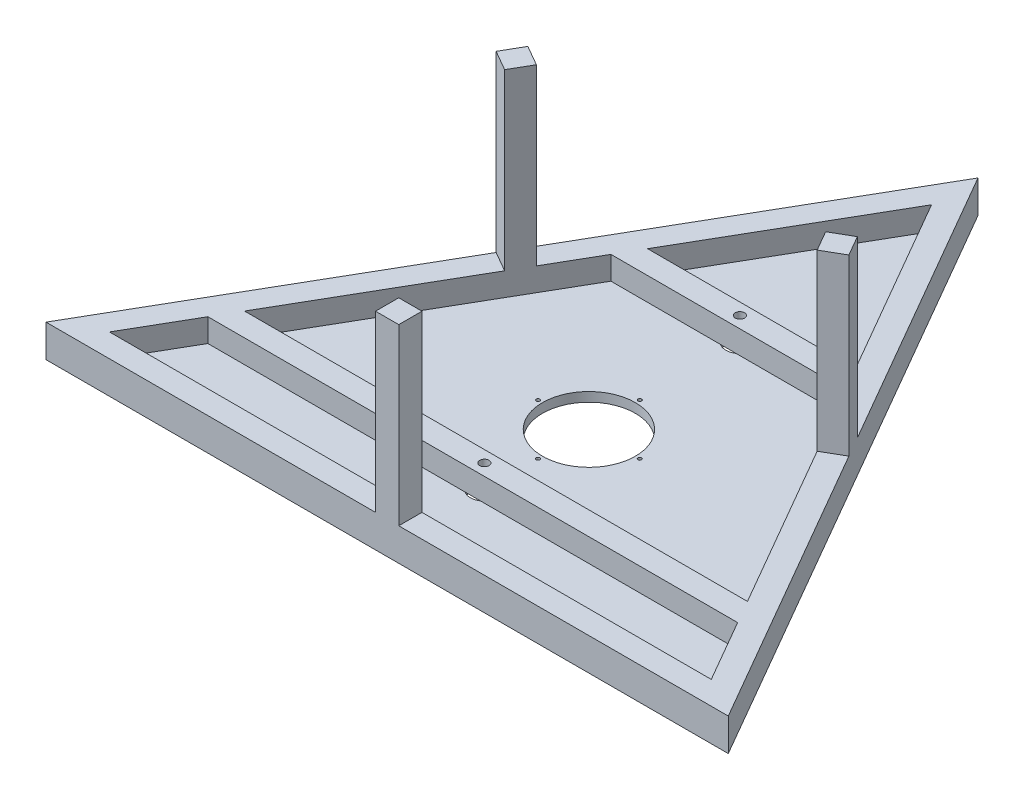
ISO-10303-21;
HEADER;
FILE_DESCRIPTION(('STEP AP214'),'2;1');
FILE_NAME('part.step','',(''),(''),'','','');
FILE_SCHEMA(('AUTOMOTIVE_DESIGN { 1 0 10303 214 1 1 1 1 }'));
ENDSEC;
DATA;
#1=APPLICATION_CONTEXT('core data for automotive mechanical design processes');
#2=APPLICATION_PROTOCOL_DEFINITION('international standard','automotive_design',2000,#1);
#3=PRODUCT_CONTEXT('',#1,'mechanical');
#4=PRODUCT('Part','Part','',(#3));
#5=PRODUCT_RELATED_PRODUCT_CATEGORY('part','',(#4));
#6=PRODUCT_DEFINITION_FORMATION('','',#4);
#7=PRODUCT_DEFINITION_CONTEXT('part definition',#1,'design');
#8=PRODUCT_DEFINITION('design','',#6,#7);
#9=PRODUCT_DEFINITION_SHAPE('','',#8);
#10=(LENGTH_UNIT() NAMED_UNIT(*) SI_UNIT(.MILLI.,.METRE.));
#11=(NAMED_UNIT(*) PLANE_ANGLE_UNIT() SI_UNIT($,.RADIAN.));
#12=(NAMED_UNIT(*) SI_UNIT($,.STERADIAN.) SOLID_ANGLE_UNIT());
#13=UNCERTAINTY_MEASURE_WITH_UNIT(LENGTH_MEASURE(1.E-05),#10,'distance_accuracy_value','');
#14=(GEOMETRIC_REPRESENTATION_CONTEXT(3) GLOBAL_UNCERTAINTY_ASSIGNED_CONTEXT((#13)) GLOBAL_UNIT_ASSIGNED_CONTEXT((#10,
#11,#12)) REPRESENTATION_CONTEXT('',''));
#15=CARTESIAN_POINT('',(0.,0.,0.));
#16=DIRECTION('',(0.,0.,1.));
#17=DIRECTION('',(1.,0.,0.));
#18=AXIS2_PLACEMENT_3D('',#15,#16,#17);
#19=CARTESIAN_POINT('',(0.,0.,0.));
#20=DIRECTION('',(0.,1.,0.));
#21=DIRECTION('',(0.,0.,1.));
#22=AXIS2_PLACEMENT_3D('',#19,#20,#21);
#23=PLANE('',#22);
#24=CARTESIAN_POINT('',(0.,0.,130.));
#25=DIRECTION('',(0.,1.,0.));
#26=DIRECTION('',(0.,0.,1.));
#27=AXIS2_PLACEMENT_3D('',#24,#25,#26);
#28=CIRCLE('',#27,4.);
#29=CARTESIAN_POINT('',(0.,0.,134.));
#30=VERTEX_POINT('',#29);
#31=EDGE_CURVE('E425',#30,#30,#28,.T.);
#32=ORIENTED_EDGE('',*,*,#31,.T.);
#33=EDGE_LOOP('',(#32));
#34=FACE_BOUND('',#33,.T.);
#35=DIRECTION('',(1.,0.,0.));
#36=VECTOR('',#35,1.);
#37=CARTESIAN_POINT('',(0.,0.,120.));
#38=LINE('',#37,#36);
#39=CARTESIAN_POINT('',(-6.63324958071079,0.,120.));
#40=VERTEX_POINT('',#39);
#41=CARTESIAN_POINT('',(6.63324958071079,0.,120.));
#42=VERTEX_POINT('',#41);
#43=EDGE_CURVE('E480',#40,#42,#38,.T.);
#44=ORIENTED_EDGE('',*,*,#43,.T.);
#45=CARTESIAN_POINT('',(0.,0.,130.));
#46=DIRECTION('',(0.,-1.,0.));
#47=DIRECTION('',(0.,0.,-1.));
#48=AXIS2_PLACEMENT_3D('',#45,#46,#47);
#49=CIRCLE('',#48,12.);
#50=CARTESIAN_POINT('',(6.63324958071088,0.,140.));
#51=VERTEX_POINT('',#50);
#52=EDGE_CURVE('E130',#42,#51,#49,.T.);
#53=ORIENTED_EDGE('',*,*,#52,.T.);
#54=DIRECTION('',(1.,0.,0.));
#55=VECTOR('',#54,1.);
#56=CARTESIAN_POINT('',(0.,0.,140.));
#57=LINE('',#56,#55);
#58=CARTESIAN_POINT('',(-6.63324958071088,0.,140.));
#59=VERTEX_POINT('',#58);
#60=EDGE_CURVE('E517',#59,#51,#57,.T.);
#61=ORIENTED_EDGE('',*,*,#60,.F.);
#62=EDGE_CURVE('E12',#59,#40,#49,.T.);
#63=ORIENTED_EDGE('',*,*,#62,.T.);
#64=EDGE_LOOP('',(#44,#53,#61,#63));
#65=FACE_BOUND('',#64,.T.);
#66=ADVANCED_FACE('F119',(#34,#65),#23,.F.);
#67=CARTESIAN_POINT('',(0.,0.,-90.));
#68=DIRECTION('',(0.,1.,0.));
#69=DIRECTION('',(0.,0.,1.));
#70=AXIS2_PLACEMENT_3D('',#67,#68,#69);
#71=CIRCLE('',#70,4.);
#72=CARTESIAN_POINT('',(0.,0.,-86.));
#73=VERTEX_POINT('',#72);
#74=EDGE_CURVE('E429',#73,#73,#71,.T.);
#75=ORIENTED_EDGE('',*,*,#74,.T.);
#76=EDGE_LOOP('',(#75));
#77=FACE_BOUND('',#76,.T.);
#78=DIRECTION('',(1.,0.,0.));
#79=VECTOR('',#78,1.);
#80=CARTESIAN_POINT('',(0.,0.,-100.));
#81=LINE('',#80,#79);
#82=CARTESIAN_POINT('',(-6.63324958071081,0.,-100.));
#83=VERTEX_POINT('',#82);
#84=CARTESIAN_POINT('',(6.63324958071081,0.,-100.));
#85=VERTEX_POINT('',#84);
#86=EDGE_CURVE('E450',#83,#85,#81,.T.);
#87=ORIENTED_EDGE('',*,*,#86,.T.);
#88=CARTESIAN_POINT('',(0.,0.,-90.));
#89=DIRECTION('',(0.,-1.,0.));
#90=DIRECTION('',(0.,0.,-1.));
#91=AXIS2_PLACEMENT_3D('',#88,#89,#90);
#92=CIRCLE('',#91,12.);
#93=CARTESIAN_POINT('',(6.63324958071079,0.,-80.));
#94=VERTEX_POINT('',#93);
#95=EDGE_CURVE('E642',#85,#94,#92,.T.);
#96=ORIENTED_EDGE('',*,*,#95,.T.);
#97=DIRECTION('',(1.,0.,0.));
#98=VECTOR('',#97,1.);
#99=CARTESIAN_POINT('',(0.,0.,-80.));
#100=LINE('',#99,#98);
#101=CARTESIAN_POINT('',(-6.63324958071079,0.,-80.));
#102=VERTEX_POINT('',#101);
#103=EDGE_CURVE('E486',#102,#94,#100,.T.);
#104=ORIENTED_EDGE('',*,*,#103,.F.);
#105=EDGE_CURVE('E128',#102,#83,#92,.T.);
#106=ORIENTED_EDGE('',*,*,#105,.T.);
#107=EDGE_LOOP('',(#87,#96,#104,#106));
#108=FACE_BOUND('',#107,.T.);
#109=ADVANCED_FACE('F681',(#77,#108),#23,.F.);
#110=CARTESIAN_POINT('',(0.,20.,0.));
#111=DIRECTION('',(0.,1.,0.));
#112=DIRECTION('',(0.,0.,1.));
#113=AXIS2_PLACEMENT_3D('',#110,#111,#112);
#114=PLANE('',#113);
#115=DIRECTION('',(-0.5,0.,-0.866025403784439));
#116=VECTOR('',#115,1.);
#117=CARTESIAN_POINT('',(110.418238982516,20.,-63.75));
#118=LINE('',#117,#116);
#119=CARTESIAN_POINT('',(89.489291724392,20.,-100.));
#120=VERTEX_POINT('',#119);
#121=CARTESIAN_POINT('',(0.,20.,-255.));
#122=VERTEX_POINT('',#121);
#123=EDGE_CURVE('E440',#120,#122,#118,.T.);
#124=ORIENTED_EDGE('',*,*,#123,.F.);
#125=DIRECTION('',(1.,0.,0.));
#126=VECTOR('',#125,1.);
#127=CARTESIAN_POINT('',(0.,20.,-100.));
#128=LINE('',#127,#126);
#129=CARTESIAN_POINT('',(-89.489291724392,20.,-100.));
#130=VERTEX_POINT('',#129);
#131=EDGE_CURVE('E438',#130,#120,#128,.T.);
#132=ORIENTED_EDGE('',*,*,#131,.F.);
#133=DIRECTION('',(-0.5,0.,0.866025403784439));
#134=VECTOR('',#133,1.);
#135=CARTESIAN_POINT('',(-110.418238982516,20.,-63.75));
#136=LINE('',#135,#134);
#137=EDGE_CURVE('E444',#122,#130,#136,.T.);
#138=ORIENTED_EDGE('',*,*,#137,.F.);
#139=EDGE_LOOP('',(#124,#132,#138));
#140=FACE_BOUND('',#139,.T.);
#141=CARTESIAN_POINT('',(0.,20.,-90.));
#142=DIRECTION('',(0.,1.,0.));
#143=DIRECTION('',(0.,0.,1.));
#144=AXIS2_PLACEMENT_3D('',#141,#142,#143);
#145=CIRCLE('',#144,4.);
#146=CARTESIAN_POINT('',(0.,20.,-86.));
#147=VERTEX_POINT('',#146);
#148=EDGE_CURVE('E432',#147,#147,#145,.T.);
#149=ORIENTED_EDGE('',*,*,#148,.F.);
#150=EDGE_LOOP('',(#149));
#151=FACE_BOUND('',#150,.T.);
#152=DIRECTION('',(-0.5,0.,-0.866025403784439));
#153=VECTOR('',#152,1.);
#154=CARTESIAN_POINT('',(110.418238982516,20.,-63.75));
#155=LINE('',#154,#153);
#156=CARTESIAN_POINT('',(124.533666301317,20.,-39.301362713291));
#157=VERTEX_POINT('',#156);
#158=CARTESIAN_POINT('',(101.036297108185,20.,-80.));
#159=VERTEX_POINT('',#158);
#160=EDGE_CURVE('E464',#157,#159,#155,.T.);
#161=ORIENTED_EDGE('',*,*,#160,.F.);
#162=DIRECTION('',(-0.866025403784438,0.,0.500000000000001));
#163=VECTOR('',#162,1.);
#164=CARTESIAN_POINT('',(141.854174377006,20.,-49.301362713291));
#165=LINE('',#164,#163);
#166=CARTESIAN_POINT('',(141.854174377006,20.,-49.301362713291));
#167=VERTEX_POINT('',#166);
#168=EDGE_CURVE('E360',#167,#157,#165,.T.);
#169=ORIENTED_EDGE('',*,*,#168,.F.);
#170=DIRECTION('',(-0.5,0.,-0.866025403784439));
#171=VECTOR('',#170,1.);
#172=CARTESIAN_POINT('',(293.708348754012,20.,213.717782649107));
#173=LINE('',#172,#171);
#174=CARTESIAN_POINT('',(0.,20.,-295.));
#175=VERTEX_POINT('',#174);
#176=EDGE_CURVE('E537',#167,#175,#173,.T.);
#177=ORIENTED_EDGE('',*,*,#176,.T.);
#178=DIRECTION('',(-0.5,0.,0.866025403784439));
#179=VECTOR('',#178,1.);
#180=CARTESIAN_POINT('',(0.,20.,-295.));
#181=LINE('',#180,#179);
#182=CARTESIAN_POINT('',(-141.854174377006,20.,-49.3013627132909));
#183=VERTEX_POINT('',#182);
#184=EDGE_CURVE('E540',#175,#183,#181,.T.);
#185=ORIENTED_EDGE('',*,*,#184,.T.);
#186=DIRECTION('',(-0.866025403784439,0.,-0.5));
#187=VECTOR('',#186,1.);
#188=CARTESIAN_POINT('',(-14.115427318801,20.,24.4486372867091));
#189=LINE('',#188,#187);
#190=CARTESIAN_POINT('',(-124.533666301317,20.,-39.3013627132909));
#191=VERTEX_POINT('',#190);
#192=EDGE_CURVE('E391',#191,#183,#189,.T.);
#193=ORIENTED_EDGE('',*,*,#192,.F.);
#194=DIRECTION('',(-0.5,0.,0.866025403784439));
#195=VECTOR('',#194,1.);
#196=CARTESIAN_POINT('',(-110.418238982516,20.,-63.75));
#197=LINE('',#196,#195);
#198=CARTESIAN_POINT('',(-101.036297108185,20.,-80.));
#199=VERTEX_POINT('',#198);
#200=EDGE_CURVE('E473',#199,#191,#197,.T.);
#201=ORIENTED_EDGE('',*,*,#200,.F.);
#202=DIRECTION('',(1.,0.,0.));
#203=VECTOR('',#202,1.);
#204=CARTESIAN_POINT('',(0.,20.,-80.));
#205=LINE('',#204,#203);
#206=EDGE_CURVE('E469',#199,#159,#205,.T.);
#207=ORIENTED_EDGE('',*,*,#206,.T.);
#208=EDGE_LOOP('',(#161,#169,#177,#185,#193,#201,#207));
#209=FACE_BOUND('',#208,.T.);
#210=ADVANCED_FACE('F550',(#140,#151,#209),#114,.T.);
#211=DIRECTION('',(-0.866025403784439,0.,0.499999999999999));
#212=VECTOR('',#211,1.);
#213=CARTESIAN_POINT('',(151.854174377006,20.,-31.9808546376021));
#214=LINE('',#213,#212);
#215=CARTESIAN_POINT('',(151.854174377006,20.,-31.9808546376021));
#216=VERTEX_POINT('',#215);
#217=CARTESIAN_POINT('',(134.533666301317,20.,-21.9808546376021));
#218=VERTEX_POINT('',#217);
#219=EDGE_CURVE('E362',#216,#218,#214,.T.);
#220=ORIENTED_EDGE('',*,*,#219,.T.);
#221=CARTESIAN_POINT('',(216.50635094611,20.,120.));
#222=VERTEX_POINT('',#221);
#223=EDGE_CURVE('E466',#222,#218,#155,.T.);
#224=ORIENTED_EDGE('',*,*,#223,.F.);
#225=DIRECTION('',(1.,0.,0.));
#226=VECTOR('',#225,1.);
#227=CARTESIAN_POINT('',(0.,20.,120.));
#228=LINE('',#227,#226);
#229=CARTESIAN_POINT('',(-216.50635094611,20.,120.));
#230=VERTEX_POINT('',#229);
#231=EDGE_CURVE('E462',#230,#222,#228,.T.);
#232=ORIENTED_EDGE('',*,*,#231,.F.);
#233=CARTESIAN_POINT('',(-134.533666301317,20.,-21.9808546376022));
#234=VERTEX_POINT('',#233);
#235=EDGE_CURVE('E472',#234,#230,#197,.T.);
#236=ORIENTED_EDGE('',*,*,#235,.F.);
#237=DIRECTION('',(-0.866025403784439,0.,-0.5));
#238=VECTOR('',#237,1.);
#239=CARTESIAN_POINT('',(-24.115427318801,20.,41.7691453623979));
#240=LINE('',#239,#238);
#241=CARTESIAN_POINT('',(-151.854174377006,20.,-31.9808546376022));
#242=VERTEX_POINT('',#241);
#243=EDGE_CURVE('E403',#234,#242,#240,.T.);
#244=ORIENTED_EDGE('',*,*,#243,.T.);
#245=CARTESIAN_POINT('',(-293.708348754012,20.,213.717782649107));
#246=VERTEX_POINT('',#245);
#247=EDGE_CURVE('E539',#242,#246,#181,.T.);
#248=ORIENTED_EDGE('',*,*,#247,.T.);
#249=DIRECTION('',(1.,0.,0.));
#250=VECTOR('',#249,1.);
#251=CARTESIAN_POINT('',(-293.708348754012,20.,213.717782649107));
#252=LINE('',#251,#250);
#253=CARTESIAN_POINT('',(-10.,20.,213.717782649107));
#254=VERTEX_POINT('',#253);
#255=EDGE_CURVE('E534',#246,#254,#252,.T.);
#256=ORIENTED_EDGE('',*,*,#255,.T.);
#257=DIRECTION('',(0.,0.,1.));
#258=VECTOR('',#257,1.);
#259=CARTESIAN_POINT('',(-10.,20.,0.));
#260=LINE('',#259,#258);
#261=CARTESIAN_POINT('',(-10.,20.,193.717782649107));
#262=VERTEX_POINT('',#261);
#263=EDGE_CURVE('E385',#262,#254,#260,.T.);
#264=ORIENTED_EDGE('',*,*,#263,.F.);
#265=DIRECTION('',(1.,0.,0.));
#266=VECTOR('',#265,1.);
#267=CARTESIAN_POINT('',(0.,20.,193.717782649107));
#268=LINE('',#267,#266);
#269=CARTESIAN_POINT('',(-259.067332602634,20.,193.717782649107));
#270=VERTEX_POINT('',#269);
#271=EDGE_CURVE('E507',#270,#262,#268,.T.);
#272=ORIENTED_EDGE('',*,*,#271,.F.);
#273=DIRECTION('',(-0.499999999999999,0.,0.866025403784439));
#274=VECTOR('',#273,1.);
#275=CARTESIAN_POINT('',(-110.418238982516,20.,-63.75));
#276=LINE('',#275,#274);
#277=CARTESIAN_POINT('',(-228.053356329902,20.,140.));
#278=VERTEX_POINT('',#277);
#279=EDGE_CURVE('E503',#278,#270,#276,.T.);
#280=ORIENTED_EDGE('',*,*,#279,.F.);
#281=DIRECTION('',(1.,0.,0.));
#282=VECTOR('',#281,1.);
#283=CARTESIAN_POINT('',(0.,20.,140.));
#284=LINE('',#283,#282);
#285=CARTESIAN_POINT('',(228.053356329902,20.,140.));
#286=VERTEX_POINT('',#285);
#287=EDGE_CURVE('E500',#278,#286,#284,.T.);
#288=ORIENTED_EDGE('',*,*,#287,.T.);
#289=DIRECTION('',(-0.5,0.,-0.866025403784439));
#290=VECTOR('',#289,1.);
#291=CARTESIAN_POINT('',(110.418238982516,20.,-63.75));
#292=LINE('',#291,#290);
#293=CARTESIAN_POINT('',(259.067332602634,20.,193.717782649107));
#294=VERTEX_POINT('',#293);
#295=EDGE_CURVE('E510',#294,#286,#292,.T.);
#296=ORIENTED_EDGE('',*,*,#295,.F.);
#297=CARTESIAN_POINT('',(10.,20.,193.717782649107));
#298=VERTEX_POINT('',#297);
#299=EDGE_CURVE('E506',#298,#294,#268,.T.);
#300=ORIENTED_EDGE('',*,*,#299,.F.);
#301=DIRECTION('',(0.,0.,1.));
#302=VECTOR('',#301,1.);
#303=CARTESIAN_POINT('',(9.99999999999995,20.,0.));
#304=LINE('',#303,#302);
#305=CARTESIAN_POINT('',(10.,20.,213.717782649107));
#306=VERTEX_POINT('',#305);
#307=EDGE_CURVE('E387',#298,#306,#304,.T.);
#308=ORIENTED_EDGE('',*,*,#307,.T.);
#309=CARTESIAN_POINT('',(293.708348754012,20.,213.717782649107));
#310=VERTEX_POINT('',#309);
#311=EDGE_CURVE('E533',#306,#310,#252,.T.);
#312=ORIENTED_EDGE('',*,*,#311,.T.);
#313=EDGE_CURVE('E328',#310,#216,#173,.T.);
#314=ORIENTED_EDGE('',*,*,#313,.T.);
#315=EDGE_LOOP('',(#220,#224,#232,#236,#244,#248,#256,#264,#272,#280,#288,#296,#300,#308,#312,#314));
#316=FACE_BOUND('',#315,.T.);
#317=CARTESIAN_POINT('',(0.,20.,130.));
#318=DIRECTION('',(0.,1.,0.));
#319=DIRECTION('',(0.,0.,1.));
#320=AXIS2_PLACEMENT_3D('',#317,#318,#319);
#321=CIRCLE('',#320,4.);
#322=CARTESIAN_POINT('',(0.,20.,134.));
#323=VERTEX_POINT('',#322);
#324=EDGE_CURVE('E426',#323,#323,#321,.T.);
#325=ORIENTED_EDGE('',*,*,#324,.F.);
#326=EDGE_LOOP('',(#325));
#327=FACE_BOUND('',#326,.T.);
#328=ADVANCED_FACE('F563',(#316,#327),#114,.T.);
#329=CARTESIAN_POINT('',(-293.708348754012,20.,213.717782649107));
#330=DIRECTION('',(0.,0.,-1.));
#331=DIRECTION('',(-1.,0.,0.));
#332=AXIS2_PLACEMENT_3D('',#329,#330,#331);
#333=PLANE('',#332);
#334=DIRECTION('',(0.,-1.,0.));
#335=VECTOR('',#334,1.);
#336=CARTESIAN_POINT('',(-293.708348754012,20.,213.717782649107));
#337=LINE('',#336,#335);
#338=CARTESIAN_POINT('',(-293.708348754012,-8.,213.717782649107));
#339=VERTEX_POINT('',#338);
#340=EDGE_CURVE('E336',#246,#339,#337,.T.);
#341=ORIENTED_EDGE('',*,*,#340,.T.);
#342=DIRECTION('',(-1.,0.,0.));
#343=VECTOR('',#342,1.);
#344=CARTESIAN_POINT('',(-293.708348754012,-8.,213.717782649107));
#345=LINE('',#344,#343);
#346=CARTESIAN_POINT('',(293.708348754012,-8.,213.717782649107));
#347=VERTEX_POINT('',#346);
#348=EDGE_CURVE('E333',#347,#339,#345,.T.);
#349=ORIENTED_EDGE('',*,*,#348,.F.);
#350=DIRECTION('',(0.,-1.,0.));
#351=VECTOR('',#350,1.);
#352=CARTESIAN_POINT('',(293.708348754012,20.,213.717782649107));
#353=LINE('',#352,#351);
#354=EDGE_CURVE('E123',#310,#347,#353,.T.);
#355=ORIENTED_EDGE('',*,*,#354,.F.);
#356=ORIENTED_EDGE('',*,*,#311,.F.);
#357=DIRECTION('',(0.,-1.,0.));
#358=VECTOR('',#357,1.);
#359=CARTESIAN_POINT('',(10.,170.,213.717782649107));
#360=LINE('',#359,#358);
#361=CARTESIAN_POINT('',(10.,170.,213.717782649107));
#362=VERTEX_POINT('',#361);
#363=EDGE_CURVE('E382',#362,#306,#360,.T.);
#364=ORIENTED_EDGE('',*,*,#363,.F.);
#365=DIRECTION('',(1.,0.,0.));
#366=VECTOR('',#365,1.);
#367=CARTESIAN_POINT('',(0.,170.,213.717782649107));
#368=LINE('',#367,#366);
#369=CARTESIAN_POINT('',(-10.,170.,213.717782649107));
#370=VERTEX_POINT('',#369);
#371=EDGE_CURVE('E384',#370,#362,#368,.T.);
#372=ORIENTED_EDGE('',*,*,#371,.F.);
#373=DIRECTION('',(0.,-1.,0.));
#374=VECTOR('',#373,1.);
#375=CARTESIAN_POINT('',(-10.,170.,213.717782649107));
#376=LINE('',#375,#374);
#377=EDGE_CURVE('E379',#370,#254,#376,.T.);
#378=ORIENTED_EDGE('',*,*,#377,.T.);
#379=ORIENTED_EDGE('',*,*,#255,.F.);
#380=EDGE_LOOP('',(#341,#349,#355,#356,#364,#372,#378,#379));
#381=FACE_BOUND('',#380,.T.);
#382=ADVANCED_FACE('F121',(#381),#333,.F.);
#383=CARTESIAN_POINT('',(293.708348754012,20.,213.717782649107));
#384=DIRECTION('',(-0.866025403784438,0.,0.5));
#385=DIRECTION('',(0.5,0.,0.866025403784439));
#386=AXIS2_PLACEMENT_3D('',#383,#384,#385);
#387=PLANE('',#386);
#388=ORIENTED_EDGE('',*,*,#354,.T.);
#389=DIRECTION('',(0.5,0.,0.866025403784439));
#390=VECTOR('',#389,1.);
#391=CARTESIAN_POINT('',(293.708348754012,-8.,213.717782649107));
#392=LINE('',#391,#390);
#393=CARTESIAN_POINT('',(0.,-8.,-295.));
#394=VERTEX_POINT('',#393);
#395=EDGE_CURVE('E326',#394,#347,#392,.T.);
#396=ORIENTED_EDGE('',*,*,#395,.F.);
#397=DIRECTION('',(0.,-1.,0.));
#398=VECTOR('',#397,1.);
#399=CARTESIAN_POINT('',(0.,20.,-295.));
#400=LINE('',#399,#398);
#401=EDGE_CURVE('E331',#175,#394,#400,.T.);
#402=ORIENTED_EDGE('',*,*,#401,.F.);
#403=ORIENTED_EDGE('',*,*,#176,.F.);
#404=DIRECTION('',(0.,-1.,0.));
#405=VECTOR('',#404,1.);
#406=CARTESIAN_POINT('',(141.854174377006,170.,-49.301362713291));
#407=LINE('',#406,#405);
#408=CARTESIAN_POINT('',(141.854174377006,170.,-49.301362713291));
#409=VERTEX_POINT('',#408);
#410=EDGE_CURVE('E352',#409,#167,#407,.T.);
#411=ORIENTED_EDGE('',*,*,#410,.F.);
#412=DIRECTION('',(0.5,0.,0.866025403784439));
#413=VECTOR('',#412,1.);
#414=CARTESIAN_POINT('',(141.854174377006,170.,-49.301362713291));
#415=LINE('',#414,#413);
#416=CARTESIAN_POINT('',(151.854174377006,170.,-31.9808546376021));
#417=VERTEX_POINT('',#416);
#418=EDGE_CURVE('E363',#409,#417,#415,.T.);
#419=ORIENTED_EDGE('',*,*,#418,.T.);
#420=DIRECTION('',(0.,-1.,0.));
#421=VECTOR('',#420,1.);
#422=CARTESIAN_POINT('',(151.854174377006,170.,-31.9808546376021));
#423=LINE('',#422,#421);
#424=EDGE_CURVE('E353',#417,#216,#423,.T.);
#425=ORIENTED_EDGE('',*,*,#424,.T.);
#426=ORIENTED_EDGE('',*,*,#313,.F.);
#427=EDGE_LOOP('',(#388,#396,#402,#403,#411,#419,#425,#426));
#428=FACE_BOUND('',#427,.T.);
#429=ADVANCED_FACE('F323',(#428),#387,.F.);
#430=CARTESIAN_POINT('',(0.,20.,-295.));
#431=DIRECTION('',(0.866025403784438,0.,0.5));
#432=DIRECTION('',(0.5,0.,-0.866025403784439));
#433=AXIS2_PLACEMENT_3D('',#430,#431,#432);
#434=PLANE('',#433);
#435=ORIENTED_EDGE('',*,*,#401,.T.);
#436=DIRECTION('',(0.5,0.,-0.866025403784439));
#437=VECTOR('',#436,1.);
#438=CARTESIAN_POINT('',(0.,-8.,-295.));
#439=LINE('',#438,#437);
#440=EDGE_CURVE('E340',#339,#394,#439,.T.);
#441=ORIENTED_EDGE('',*,*,#440,.F.);
#442=ORIENTED_EDGE('',*,*,#340,.F.);
#443=ORIENTED_EDGE('',*,*,#247,.F.);
#444=DIRECTION('',(0.,-1.,0.));
#445=VECTOR('',#444,1.);
#446=CARTESIAN_POINT('',(-151.854174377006,170.,-31.9808546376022));
#447=LINE('',#446,#445);
#448=CARTESIAN_POINT('',(-151.854174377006,170.,-31.9808546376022));
#449=VERTEX_POINT('',#448);
#450=EDGE_CURVE('E416',#449,#242,#447,.T.);
#451=ORIENTED_EDGE('',*,*,#450,.F.);
#452=DIRECTION('',(-0.5,0.,0.866025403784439));
#453=VECTOR('',#452,1.);
#454=CARTESIAN_POINT('',(-127.738747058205,170.,-73.7500000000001));
#455=LINE('',#454,#453);
#456=CARTESIAN_POINT('',(-141.854174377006,170.,-49.3013627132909));
#457=VERTEX_POINT('',#456);
#458=EDGE_CURVE('E405',#457,#449,#455,.T.);
#459=ORIENTED_EDGE('',*,*,#458,.F.);
#460=DIRECTION('',(0.,-1.,0.));
#461=VECTOR('',#460,1.);
#462=CARTESIAN_POINT('',(-141.854174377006,170.,-49.3013627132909));
#463=LINE('',#462,#461);
#464=EDGE_CURVE('E419',#457,#183,#463,.T.);
#465=ORIENTED_EDGE('',*,*,#464,.T.);
#466=ORIENTED_EDGE('',*,*,#184,.F.);
#467=EDGE_LOOP('',(#435,#441,#442,#443,#451,#459,#465,#466));
#468=FACE_BOUND('',#467,.T.);
#469=ADVANCED_FACE('F544',(#468),#434,.F.);
#470=CARTESIAN_POINT('',(0.,20.,140.));
#471=DIRECTION('',(0.,0.,-1.));
#472=DIRECTION('',(-1.,0.,0.));
#473=AXIS2_PLACEMENT_3D('',#470,#471,#472);
#474=PLANE('',#473);
#475=CARTESIAN_POINT('',(-228.053356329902,0.,140.));
#476=VERTEX_POINT('',#475);
#477=EDGE_CURVE('E513',#476,#59,#57,.T.);
#478=ORIENTED_EDGE('',*,*,#477,.T.);
#479=ORIENTED_EDGE('',*,*,#60,.T.);
#480=CARTESIAN_POINT('',(228.053356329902,0.,140.));
#481=VERTEX_POINT('',#480);
#482=EDGE_CURVE('E499',#51,#481,#57,.T.);
#483=ORIENTED_EDGE('',*,*,#482,.T.);
#484=DIRECTION('',(0.,-1.,0.));
#485=VECTOR('',#484,1.);
#486=CARTESIAN_POINT('',(228.053356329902,20.,140.));
#487=LINE('',#486,#485);
#488=EDGE_CURVE('E512',#286,#481,#487,.T.);
#489=ORIENTED_EDGE('',*,*,#488,.F.);
#490=ORIENTED_EDGE('',*,*,#287,.F.);
#491=DIRECTION('',(0.,-1.,0.));
#492=VECTOR('',#491,1.);
#493=CARTESIAN_POINT('',(-228.053356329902,20.,140.));
#494=LINE('',#493,#492);
#495=EDGE_CURVE('E530',#278,#476,#494,.T.);
#496=ORIENTED_EDGE('',*,*,#495,.T.);
#497=EDGE_LOOP('',(#478,#479,#483,#489,#490,#496));
#498=FACE_BOUND('',#497,.T.);
#499=ADVANCED_FACE('F633',(#498),#474,.F.);
#500=CARTESIAN_POINT('',(-110.418238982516,20.,-63.75));
#501=DIRECTION('',(0.866025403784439,0.,0.499999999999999));
#502=DIRECTION('',(0.499999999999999,0.,-0.866025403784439));
#503=AXIS2_PLACEMENT_3D('',#500,#501,#502);
#504=PLANE('',#503);
#505=DIRECTION('',(-0.499999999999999,0.,0.866025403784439));
#506=VECTOR('',#505,1.);
#507=CARTESIAN_POINT('',(-110.418238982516,0.,-63.75));
#508=LINE('',#507,#506);
#509=CARTESIAN_POINT('',(-259.067332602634,0.,193.717782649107));
#510=VERTEX_POINT('',#509);
#511=EDGE_CURVE('E516',#476,#510,#508,.T.);
#512=ORIENTED_EDGE('',*,*,#511,.F.);
#513=ORIENTED_EDGE('',*,*,#495,.F.);
#514=ORIENTED_EDGE('',*,*,#279,.T.);
#515=DIRECTION('',(0.,-1.,0.));
#516=VECTOR('',#515,1.);
#517=CARTESIAN_POINT('',(-259.067332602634,20.,193.717782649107));
#518=LINE('',#517,#516);
#519=EDGE_CURVE('E527',#270,#510,#518,.T.);
#520=ORIENTED_EDGE('',*,*,#519,.T.);
#521=EDGE_LOOP('',(#512,#513,#514,#520));
#522=FACE_BOUND('',#521,.T.);
#523=ADVANCED_FACE('F771',(#522),#504,.T.);
#524=CARTESIAN_POINT('',(0.,20.,193.717782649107));
#525=DIRECTION('',(0.,0.,-1.));
#526=DIRECTION('',(-1.,0.,0.));
#527=AXIS2_PLACEMENT_3D('',#524,#525,#526);
#528=PLANE('',#527);
#529=DIRECTION('',(1.,0.,0.));
#530=VECTOR('',#529,1.);
#531=CARTESIAN_POINT('',(0.,0.,193.717782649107));
#532=LINE('',#531,#530);
#533=CARTESIAN_POINT('',(259.067332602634,0.,193.717782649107));
#534=VERTEX_POINT('',#533);
#535=EDGE_CURVE('E519',#510,#534,#532,.T.);
#536=ORIENTED_EDGE('',*,*,#535,.F.);
#537=ORIENTED_EDGE('',*,*,#519,.F.);
#538=ORIENTED_EDGE('',*,*,#271,.T.);
#539=DIRECTION('',(0.,-1.,0.));
#540=VECTOR('',#539,1.);
#541=CARTESIAN_POINT('',(-10.,170.,193.717782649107));
#542=LINE('',#541,#540);
#543=CARTESIAN_POINT('',(-10.,170.,193.717782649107));
#544=VERTEX_POINT('',#543);
#545=EDGE_CURVE('E377',#544,#262,#542,.T.);
#546=ORIENTED_EDGE('',*,*,#545,.F.);
#547=DIRECTION('',(-1.,0.,0.));
#548=VECTOR('',#547,1.);
#549=CARTESIAN_POINT('',(0.,170.,193.717782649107));
#550=LINE('',#549,#548);
#551=CARTESIAN_POINT('',(10.,170.,193.717782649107));
#552=VERTEX_POINT('',#551);
#553=EDGE_CURVE('E395',#552,#544,#550,.T.);
#554=ORIENTED_EDGE('',*,*,#553,.F.);
#555=DIRECTION('',(0.,-1.,0.));
#556=VECTOR('',#555,1.);
#557=CARTESIAN_POINT('',(10.,170.,193.717782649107));
#558=LINE('',#557,#556);
#559=EDGE_CURVE('E366',#552,#298,#558,.T.);
#560=ORIENTED_EDGE('',*,*,#559,.T.);
#561=ORIENTED_EDGE('',*,*,#299,.T.);
#562=DIRECTION('',(0.,-1.,0.));
#563=VECTOR('',#562,1.);
#564=CARTESIAN_POINT('',(259.067332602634,20.,193.717782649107));
#565=LINE('',#564,#563);
#566=EDGE_CURVE('E524',#294,#534,#565,.T.);
#567=ORIENTED_EDGE('',*,*,#566,.T.);
#568=EDGE_LOOP('',(#536,#537,#538,#546,#554,#560,#561,#567));
#569=FACE_BOUND('',#568,.T.);
#570=ADVANCED_FACE('F780',(#569),#528,.T.);
#571=CARTESIAN_POINT('',(110.418238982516,20.,-63.75));
#572=DIRECTION('',(-0.866025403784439,0.,0.5));
#573=DIRECTION('',(0.5,0.,0.866025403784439));
#574=AXIS2_PLACEMENT_3D('',#571,#572,#573);
#575=PLANE('',#574);
#576=DIRECTION('',(-0.5,0.,-0.866025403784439));
#577=VECTOR('',#576,1.);
#578=CARTESIAN_POINT('',(110.418238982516,0.,-63.75));
#579=LINE('',#578,#577);
#580=EDGE_CURVE('E504',#534,#481,#579,.T.);
#581=ORIENTED_EDGE('',*,*,#580,.F.);
#582=ORIENTED_EDGE('',*,*,#566,.F.);
#583=ORIENTED_EDGE('',*,*,#295,.T.);
#584=ORIENTED_EDGE('',*,*,#488,.T.);
#585=EDGE_LOOP('',(#581,#582,#583,#584));
#586=FACE_BOUND('',#585,.T.);
#587=ADVANCED_FACE('F791',(#586),#575,.T.);
#588=CARTESIAN_POINT('',(0.,20.,120.));
#589=DIRECTION('',(0.,0.,-1.));
#590=DIRECTION('',(-1.,0.,0.));
#591=AXIS2_PLACEMENT_3D('',#588,#589,#590);
#592=PLANE('',#591);
#593=CARTESIAN_POINT('',(-216.50635094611,0.,120.));
#594=VERTEX_POINT('',#593);
#595=EDGE_CURVE('E477',#594,#40,#38,.T.);
#596=ORIENTED_EDGE('',*,*,#595,.F.);
#597=DIRECTION('',(0.,-1.,0.));
#598=VECTOR('',#597,1.);
#599=CARTESIAN_POINT('',(-216.50635094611,20.,120.));
#600=LINE('',#599,#598);
#601=EDGE_CURVE('E476',#230,#594,#600,.T.);
#602=ORIENTED_EDGE('',*,*,#601,.F.);
#603=ORIENTED_EDGE('',*,*,#231,.T.);
#604=DIRECTION('',(0.,-1.,0.));
#605=VECTOR('',#604,1.);
#606=CARTESIAN_POINT('',(216.50635094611,20.,120.));
#607=LINE('',#606,#605);
#608=CARTESIAN_POINT('',(216.50635094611,0.,120.));
#609=VERTEX_POINT('',#608);
#610=EDGE_CURVE('E496',#222,#609,#607,.T.);
#611=ORIENTED_EDGE('',*,*,#610,.T.);
#612=EDGE_CURVE('E461',#42,#609,#38,.T.);
#613=ORIENTED_EDGE('',*,*,#612,.F.);
#614=ORIENTED_EDGE('',*,*,#43,.F.);
#615=EDGE_LOOP('',(#596,#602,#603,#611,#613,#614));
#616=FACE_BOUND('',#615,.T.);
#617=ADVANCED_FACE('F612',(#616),#592,.T.);
#618=CARTESIAN_POINT('',(110.418238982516,20.,-63.75));
#619=DIRECTION('',(-0.866025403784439,0.,0.5));
#620=DIRECTION('',(0.5,0.,0.866025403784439));
#621=AXIS2_PLACEMENT_3D('',#618,#619,#620);
#622=PLANE('',#621);
#623=DIRECTION('',(-0.5,0.,-0.866025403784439));
#624=VECTOR('',#623,1.);
#625=CARTESIAN_POINT('',(110.418238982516,0.,-63.75));
#626=LINE('',#625,#624);
#627=CARTESIAN_POINT('',(101.036297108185,0.,-80.));
#628=VERTEX_POINT('',#627);
#629=EDGE_CURVE('E479',#609,#628,#626,.T.);
#630=ORIENTED_EDGE('',*,*,#629,.F.);
#631=ORIENTED_EDGE('',*,*,#610,.F.);
#632=ORIENTED_EDGE('',*,*,#223,.T.);
#633=DIRECTION('',(0.,-1.,0.));
#634=VECTOR('',#633,1.);
#635=CARTESIAN_POINT('',(134.533666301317,170.,-21.9808546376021));
#636=LINE('',#635,#634);
#637=CARTESIAN_POINT('',(134.533666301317,170.,-21.9808546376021));
#638=VERTEX_POINT('',#637);
#639=EDGE_CURVE('E356',#638,#218,#636,.T.);
#640=ORIENTED_EDGE('',*,*,#639,.F.);
#641=DIRECTION('',(0.5,0.,0.866025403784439));
#642=VECTOR('',#641,1.);
#643=CARTESIAN_POINT('',(124.533666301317,170.,-39.3013627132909));
#644=LINE('',#643,#642);
#645=CARTESIAN_POINT('',(124.533666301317,170.,-39.3013627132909));
#646=VERTEX_POINT('',#645);
#647=EDGE_CURVE('E368',#646,#638,#644,.T.);
#648=ORIENTED_EDGE('',*,*,#647,.F.);
#649=DIRECTION('',(0.,-1.,0.));
#650=VECTOR('',#649,1.);
#651=CARTESIAN_POINT('',(124.533666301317,170.,-39.3013627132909));
#652=LINE('',#651,#650);
#653=EDGE_CURVE('E146',#646,#157,#652,.T.);
#654=ORIENTED_EDGE('',*,*,#653,.T.);
#655=ORIENTED_EDGE('',*,*,#160,.T.);
#656=DIRECTION('',(0.,-1.,0.));
#657=VECTOR('',#656,1.);
#658=CARTESIAN_POINT('',(101.036297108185,20.,-80.));
#659=LINE('',#658,#657);
#660=EDGE_CURVE('E493',#159,#628,#659,.T.);
#661=ORIENTED_EDGE('',*,*,#660,.T.);
#662=EDGE_LOOP('',(#630,#631,#632,#640,#648,#654,#655,#661));
#663=FACE_BOUND('',#662,.T.);
#664=ADVANCED_FACE('F606',(#663),#622,.T.);
#665=CARTESIAN_POINT('',(0.,20.,-80.));
#666=DIRECTION('',(0.,0.,-1.));
#667=DIRECTION('',(-1.,0.,0.));
#668=AXIS2_PLACEMENT_3D('',#665,#666,#667);
#669=PLANE('',#668);
#670=CARTESIAN_POINT('',(-101.036297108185,0.,-80.));
#671=VERTEX_POINT('',#670);
#672=EDGE_CURVE('E483',#671,#102,#100,.T.);
#673=ORIENTED_EDGE('',*,*,#672,.T.);
#674=ORIENTED_EDGE('',*,*,#103,.T.);
#675=EDGE_CURVE('E482',#94,#628,#100,.T.);
#676=ORIENTED_EDGE('',*,*,#675,.T.);
#677=ORIENTED_EDGE('',*,*,#660,.F.);
#678=ORIENTED_EDGE('',*,*,#206,.F.);
#679=DIRECTION('',(0.,-1.,0.));
#680=VECTOR('',#679,1.);
#681=CARTESIAN_POINT('',(-101.036297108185,20.,-80.));
#682=LINE('',#681,#680);
#683=EDGE_CURVE('E490',#199,#671,#682,.T.);
#684=ORIENTED_EDGE('',*,*,#683,.T.);
#685=EDGE_LOOP('',(#673,#674,#676,#677,#678,#684));
#686=FACE_BOUND('',#685,.T.);
#687=ADVANCED_FACE('F601',(#686),#669,.F.);
#688=CARTESIAN_POINT('',(-110.418238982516,20.,-63.75));
#689=DIRECTION('',(0.866025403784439,0.,0.5));
#690=DIRECTION('',(0.5,0.,-0.866025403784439));
#691=AXIS2_PLACEMENT_3D('',#688,#689,#690);
#692=PLANE('',#691);
#693=DIRECTION('',(-0.5,0.,0.866025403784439));
#694=VECTOR('',#693,1.);
#695=CARTESIAN_POINT('',(-110.418238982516,0.,-63.75));
#696=LINE('',#695,#694);
#697=EDGE_CURVE('E465',#671,#594,#696,.T.);
#698=ORIENTED_EDGE('',*,*,#697,.F.);
#699=ORIENTED_EDGE('',*,*,#683,.F.);
#700=ORIENTED_EDGE('',*,*,#200,.T.);
#701=DIRECTION('',(0.,-1.,0.));
#702=VECTOR('',#701,1.);
#703=CARTESIAN_POINT('',(-124.533666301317,170.,-39.3013627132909));
#704=LINE('',#703,#702);
#705=CARTESIAN_POINT('',(-124.533666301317,170.,-39.3013627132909));
#706=VERTEX_POINT('',#705);
#707=EDGE_CURVE('E422',#706,#191,#704,.T.);
#708=ORIENTED_EDGE('',*,*,#707,.F.);
#709=DIRECTION('',(0.5,0.,-0.866025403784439));
#710=VECTOR('',#709,1.);
#711=CARTESIAN_POINT('',(-110.418238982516,170.,-63.75));
#712=LINE('',#711,#710);
#713=CARTESIAN_POINT('',(-134.533666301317,170.,-21.9808546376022));
#714=VERTEX_POINT('',#713);
#715=EDGE_CURVE('E399',#714,#706,#712,.T.);
#716=ORIENTED_EDGE('',*,*,#715,.F.);
#717=DIRECTION('',(0.,-1.,0.));
#718=VECTOR('',#717,1.);
#719=CARTESIAN_POINT('',(-134.533666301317,170.,-21.9808546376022));
#720=LINE('',#719,#718);
#721=EDGE_CURVE('E410',#714,#234,#720,.T.);
#722=ORIENTED_EDGE('',*,*,#721,.T.);
#723=ORIENTED_EDGE('',*,*,#235,.T.);
#724=ORIENTED_EDGE('',*,*,#601,.T.);
#725=EDGE_LOOP('',(#698,#699,#700,#708,#716,#722,#723,#724));
#726=FACE_BOUND('',#725,.T.);
#727=ADVANCED_FACE('F599',(#726),#692,.T.);
#728=CARTESIAN_POINT('',(0.,20.,-100.));
#729=DIRECTION('',(0.,0.,-1.));
#730=DIRECTION('',(-1.,0.,0.));
#731=AXIS2_PLACEMENT_3D('',#728,#729,#730);
#732=PLANE('',#731);
#733=CARTESIAN_POINT('',(-89.489291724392,0.,-100.));
#734=VERTEX_POINT('',#733);
#735=EDGE_CURVE('E447',#734,#83,#81,.T.);
#736=ORIENTED_EDGE('',*,*,#735,.F.);
#737=DIRECTION('',(0.,-1.,0.));
#738=VECTOR('',#737,1.);
#739=CARTESIAN_POINT('',(-89.489291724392,20.,-100.));
#740=LINE('',#739,#738);
#741=EDGE_CURVE('E446',#130,#734,#740,.T.);
#742=ORIENTED_EDGE('',*,*,#741,.F.);
#743=ORIENTED_EDGE('',*,*,#131,.T.);
#744=DIRECTION('',(0.,-1.,0.));
#745=VECTOR('',#744,1.);
#746=CARTESIAN_POINT('',(89.489291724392,20.,-100.));
#747=LINE('',#746,#745);
#748=CARTESIAN_POINT('',(89.489291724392,0.,-100.));
#749=VERTEX_POINT('',#748);
#750=EDGE_CURVE('E458',#120,#749,#747,.T.);
#751=ORIENTED_EDGE('',*,*,#750,.T.);
#752=EDGE_CURVE('E435',#85,#749,#81,.T.);
#753=ORIENTED_EDGE('',*,*,#752,.F.);
#754=ORIENTED_EDGE('',*,*,#86,.F.);
#755=EDGE_LOOP('',(#736,#742,#743,#751,#753,#754));
#756=FACE_BOUND('',#755,.T.);
#757=ADVANCED_FACE('F685',(#756),#732,.T.);
#758=CARTESIAN_POINT('',(110.418238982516,20.,-63.75));
#759=DIRECTION('',(-0.866025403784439,0.,0.5));
#760=DIRECTION('',(0.5,0.,0.866025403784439));
#761=AXIS2_PLACEMENT_3D('',#758,#759,#760);
#762=PLANE('',#761);
#763=DIRECTION('',(-0.5,0.,-0.866025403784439));
#764=VECTOR('',#763,1.);
#765=CARTESIAN_POINT('',(110.418238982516,0.,-63.75));
#766=LINE('',#765,#764);
#767=CARTESIAN_POINT('',(0.,0.,-255.));
#768=VERTEX_POINT('',#767);
#769=EDGE_CURVE('E449',#749,#768,#766,.T.);
#770=ORIENTED_EDGE('',*,*,#769,.F.);
#771=ORIENTED_EDGE('',*,*,#750,.F.);
#772=ORIENTED_EDGE('',*,*,#123,.T.);
#773=DIRECTION('',(0.,-1.,0.));
#774=VECTOR('',#773,1.);
#775=CARTESIAN_POINT('',(0.,20.,-255.));
#776=LINE('',#775,#774);
#777=EDGE_CURVE('E455',#122,#768,#776,.T.);
#778=ORIENTED_EDGE('',*,*,#777,.T.);
#779=EDGE_LOOP('',(#770,#771,#772,#778));
#780=FACE_BOUND('',#779,.T.);
#781=ADVANCED_FACE('F691',(#780),#762,.T.);
#782=CARTESIAN_POINT('',(-110.418238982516,20.,-63.75));
#783=DIRECTION('',(0.866025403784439,0.,0.5));
#784=DIRECTION('',(0.5,0.,-0.866025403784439));
#785=AXIS2_PLACEMENT_3D('',#782,#783,#784);
#786=PLANE('',#785);
#787=DIRECTION('',(-0.5,0.,0.866025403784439));
#788=VECTOR('',#787,1.);
#789=CARTESIAN_POINT('',(-110.418238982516,0.,-63.75));
#790=LINE('',#789,#788);
#791=EDGE_CURVE('E441',#768,#734,#790,.T.);
#792=ORIENTED_EDGE('',*,*,#791,.F.);
#793=ORIENTED_EDGE('',*,*,#777,.F.);
#794=ORIENTED_EDGE('',*,*,#137,.T.);
#795=ORIENTED_EDGE('',*,*,#741,.T.);
#796=EDGE_LOOP('',(#792,#793,#794,#795));
#797=FACE_BOUND('',#796,.T.);
#798=ADVANCED_FACE('F699',(#797),#786,.T.);
#799=CARTESIAN_POINT('',(0.,20.,-90.));
#800=DIRECTION('',(0.,-1.,0.));
#801=DIRECTION('',(0.,0.,-1.));
#802=AXIS2_PLACEMENT_3D('',#799,#800,#801);
#803=CYLINDRICAL_SURFACE('',#802,4.);
#804=ORIENTED_EDGE('',*,*,#148,.T.);
#805=EDGE_LOOP('',(#804));
#806=FACE_BOUND('',#805,.T.);
#807=ORIENTED_EDGE('',*,*,#74,.F.);
#808=EDGE_LOOP('',(#807));
#809=FACE_BOUND('',#808,.T.);
#810=ADVANCED_FACE('F701',(#806,#809),#803,.F.);
#811=CARTESIAN_POINT('',(0.,20.,130.));
#812=DIRECTION('',(0.,-1.,0.));
#813=DIRECTION('',(0.,0.,-1.));
#814=AXIS2_PLACEMENT_3D('',#811,#812,#813);
#815=CYLINDRICAL_SURFACE('',#814,4.);
#816=ORIENTED_EDGE('',*,*,#324,.T.);
#817=EDGE_LOOP('',(#816));
#818=FACE_BOUND('',#817,.T.);
#819=ORIENTED_EDGE('',*,*,#31,.F.);
#820=EDGE_LOOP('',(#819));
#821=FACE_BOUND('',#820,.T.);
#822=ADVANCED_FACE('F707',(#818,#821),#815,.F.);
#823=CARTESIAN_POINT('',(-14.115427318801,170.,24.4486372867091));
#824=DIRECTION('',(-0.5,0.,0.866025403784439));
#825=DIRECTION('',(0.866025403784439,0.,0.5));
#826=AXIS2_PLACEMENT_3D('',#823,#824,#825);
#827=PLANE('',#826);
#828=ORIENTED_EDGE('',*,*,#192,.T.);
#829=ORIENTED_EDGE('',*,*,#464,.F.);
#830=DIRECTION('',(-0.866025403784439,0.,-0.5));
#831=VECTOR('',#830,1.);
#832=CARTESIAN_POINT('',(-14.115427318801,170.,24.4486372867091));
#833=LINE('',#832,#831);
#834=EDGE_CURVE('E402',#706,#457,#833,.T.);
#835=ORIENTED_EDGE('',*,*,#834,.F.);
#836=ORIENTED_EDGE('',*,*,#707,.T.);
#837=EDGE_LOOP('',(#828,#829,#835,#836));
#838=FACE_BOUND('',#837,.T.);
#839=ADVANCED_FACE('F594',(#838),#827,.F.);
#840=CARTESIAN_POINT('',(-24.115427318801,170.,41.7691453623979));
#841=DIRECTION('',(-0.5,0.,0.866025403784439));
#842=DIRECTION('',(0.866025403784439,0.,0.5));
#843=AXIS2_PLACEMENT_3D('',#840,#841,#842);
#844=PLANE('',#843);
#845=ORIENTED_EDGE('',*,*,#243,.F.);
#846=ORIENTED_EDGE('',*,*,#721,.F.);
#847=DIRECTION('',(-0.866025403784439,0.,-0.5));
#848=VECTOR('',#847,1.);
#849=CARTESIAN_POINT('',(-24.115427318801,170.,41.7691453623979));
#850=LINE('',#849,#848);
#851=EDGE_CURVE('E407',#714,#449,#850,.T.);
#852=ORIENTED_EDGE('',*,*,#851,.T.);
#853=ORIENTED_EDGE('',*,*,#450,.T.);
#854=EDGE_LOOP('',(#845,#846,#852,#853));
#855=FACE_BOUND('',#854,.T.);
#856=ADVANCED_FACE('F586',(#855),#844,.T.);
#857=CARTESIAN_POINT('',(0.,170.,0.));
#858=DIRECTION('',(0.,1.,0.));
#859=DIRECTION('',(0.,0.,1.));
#860=AXIS2_PLACEMENT_3D('',#857,#858,#859);
#861=PLANE('',#860);
#862=ORIENTED_EDGE('',*,*,#715,.T.);
#863=ORIENTED_EDGE('',*,*,#834,.T.);
#864=ORIENTED_EDGE('',*,*,#458,.T.);
#865=ORIENTED_EDGE('',*,*,#851,.F.);
#866=EDGE_LOOP('',(#862,#863,#864,#865));
#867=FACE_BOUND('',#866,.T.);
#868=ADVANCED_FACE('F590',(#867),#861,.T.);
#869=CARTESIAN_POINT('',(9.99999999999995,170.,0.));
#870=DIRECTION('',(1.,0.,0.));
#871=DIRECTION('',(0.,0.,-1.));
#872=AXIS2_PLACEMENT_3D('',#869,#870,#871);
#873=PLANE('',#872);
#874=ORIENTED_EDGE('',*,*,#307,.F.);
#875=ORIENTED_EDGE('',*,*,#559,.F.);
#876=DIRECTION('',(0.,0.,1.));
#877=VECTOR('',#876,1.);
#878=CARTESIAN_POINT('',(9.99999999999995,170.,0.));
#879=LINE('',#878,#877);
#880=EDGE_CURVE('E388',#552,#362,#879,.T.);
#881=ORIENTED_EDGE('',*,*,#880,.T.);
#882=ORIENTED_EDGE('',*,*,#363,.T.);
#883=EDGE_LOOP('',(#874,#875,#881,#882));
#884=FACE_BOUND('',#883,.T.);
#885=ADVANCED_FACE('F570',(#884),#873,.T.);
#886=CARTESIAN_POINT('',(-10.,170.,0.));
#887=DIRECTION('',(1.,0.,0.));
#888=DIRECTION('',(0.,0.,-1.));
#889=AXIS2_PLACEMENT_3D('',#886,#887,#888);
#890=PLANE('',#889);
#891=ORIENTED_EDGE('',*,*,#263,.T.);
#892=ORIENTED_EDGE('',*,*,#377,.F.);
#893=DIRECTION('',(0.,0.,1.));
#894=VECTOR('',#893,1.);
#895=CARTESIAN_POINT('',(-10.,170.,0.));
#896=LINE('',#895,#894);
#897=EDGE_CURVE('E393',#544,#370,#896,.T.);
#898=ORIENTED_EDGE('',*,*,#897,.F.);
#899=ORIENTED_EDGE('',*,*,#545,.T.);
#900=EDGE_LOOP('',(#891,#892,#898,#899));
#901=FACE_BOUND('',#900,.T.);
#902=ADVANCED_FACE('F578',(#901),#890,.F.);
#903=CARTESIAN_POINT('',(0.,170.,0.));
#904=DIRECTION('',(0.,1.,0.));
#905=DIRECTION('',(0.,0.,1.));
#906=AXIS2_PLACEMENT_3D('',#903,#904,#905);
#907=PLANE('',#906);
#908=ORIENTED_EDGE('',*,*,#880,.F.);
#909=ORIENTED_EDGE('',*,*,#553,.T.);
#910=ORIENTED_EDGE('',*,*,#897,.T.);
#911=ORIENTED_EDGE('',*,*,#371,.T.);
#912=EDGE_LOOP('',(#908,#909,#910,#911));
#913=FACE_BOUND('',#912,.T.);
#914=ADVANCED_FACE('F573',(#913),#907,.T.);
#915=CARTESIAN_POINT('',(141.854174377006,170.,-49.301362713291));
#916=DIRECTION('',(0.500000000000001,0.,0.866025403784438));
#917=DIRECTION('',(0.866025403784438,0.,-0.500000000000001));
#918=AXIS2_PLACEMENT_3D('',#915,#916,#917);
#919=PLANE('',#918);
#920=ORIENTED_EDGE('',*,*,#168,.T.);
#921=ORIENTED_EDGE('',*,*,#653,.F.);
#922=DIRECTION('',(-0.866025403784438,0.,0.500000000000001));
#923=VECTOR('',#922,1.);
#924=CARTESIAN_POINT('',(141.854174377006,170.,-49.301362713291));
#925=LINE('',#924,#923);
#926=EDGE_CURVE('E355',#409,#646,#925,.T.);
#927=ORIENTED_EDGE('',*,*,#926,.F.);
#928=ORIENTED_EDGE('',*,*,#410,.T.);
#929=EDGE_LOOP('',(#920,#921,#927,#928));
#930=FACE_BOUND('',#929,.T.);
#931=ADVANCED_FACE('F552',(#930),#919,.F.);
#932=CARTESIAN_POINT('',(151.854174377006,170.,-31.9808546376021));
#933=DIRECTION('',(0.499999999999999,0.,0.866025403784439));
#934=DIRECTION('',(0.866025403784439,0.,-0.499999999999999));
#935=AXIS2_PLACEMENT_3D('',#932,#933,#934);
#936=PLANE('',#935);
#937=ORIENTED_EDGE('',*,*,#219,.F.);
#938=ORIENTED_EDGE('',*,*,#424,.F.);
#939=DIRECTION('',(-0.866025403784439,0.,0.499999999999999));
#940=VECTOR('',#939,1.);
#941=CARTESIAN_POINT('',(151.854174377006,170.,-31.9808546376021));
#942=LINE('',#941,#940);
#943=EDGE_CURVE('E370',#417,#638,#942,.T.);
#944=ORIENTED_EDGE('',*,*,#943,.T.);
#945=ORIENTED_EDGE('',*,*,#639,.T.);
#946=EDGE_LOOP('',(#937,#938,#944,#945));
#947=FACE_BOUND('',#946,.T.);
#948=ADVANCED_FACE('F559',(#947),#936,.T.);
#949=CARTESIAN_POINT('',(0.,170.,0.));
#950=DIRECTION('',(0.,-1.,0.));
#951=DIRECTION('',(0.,0.,-1.));
#952=AXIS2_PLACEMENT_3D('',#949,#950,#951);
#953=PLANE('',#952);
#954=ORIENTED_EDGE('',*,*,#418,.F.);
#955=ORIENTED_EDGE('',*,*,#926,.T.);
#956=ORIENTED_EDGE('',*,*,#647,.T.);
#957=ORIENTED_EDGE('',*,*,#943,.F.);
#958=EDGE_LOOP('',(#954,#955,#956,#957));
#959=FACE_BOUND('',#958,.T.);
#960=ADVANCED_FACE('F556',(#959),#953,.F.);
#961=CARTESIAN_POINT('',(0.,0.,0.));
#962=DIRECTION('',(0.,1.,0.));
#963=DIRECTION('',(0.,0.,1.));
#964=AXIS2_PLACEMENT_3D('',#961,#962,#963);
#965=PLANE('',#964);
#966=ORIENTED_EDGE('',*,*,#482,.F.);
#967=EDGE_CURVE('E131',#51,#59,#49,.T.);
#968=ORIENTED_EDGE('',*,*,#967,.T.);
#969=ORIENTED_EDGE('',*,*,#477,.F.);
#970=ORIENTED_EDGE('',*,*,#511,.T.);
#971=ORIENTED_EDGE('',*,*,#535,.T.);
#972=ORIENTED_EDGE('',*,*,#580,.T.);
#973=EDGE_LOOP('',(#966,#968,#969,#970,#971,#972));
#974=FACE_BOUND('',#973,.T.);
#975=ADVANCED_FACE('F637',(#974),#965,.T.);
#976=CARTESIAN_POINT('',(43.8,0.,40.));
#977=DIRECTION('',(0.,-1.,0.));
#978=DIRECTION('',(0.,0.,-1.));
#979=AXIS2_PLACEMENT_3D('',#976,#977,#978);
#980=CIRCLE('',#979,1.55);
#981=CARTESIAN_POINT('',(43.8,0.,38.45));
#982=VERTEX_POINT('',#981);
#983=EDGE_CURVE('E669',#982,#982,#980,.T.);
#984=ORIENTED_EDGE('',*,*,#983,.T.);
#985=EDGE_LOOP('',(#984));
#986=FACE_BOUND('',#985,.T.);
#987=CARTESIAN_POINT('',(-1.59594559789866E-13,0.,-3.8));
#988=DIRECTION('',(0.,-1.,0.));
#989=DIRECTION('',(0.,0.,-1.));
#990=AXIS2_PLACEMENT_3D('',#987,#988,#989);
#991=CIRCLE('',#990,1.55);
#992=CARTESIAN_POINT('',(-1.59594559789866E-13,0.,-5.35));
#993=VERTEX_POINT('',#992);
#994=EDGE_CURVE('E663',#993,#993,#991,.T.);
#995=ORIENTED_EDGE('',*,*,#994,.T.);
#996=EDGE_LOOP('',(#995));
#997=FACE_BOUND('',#996,.T.);
#998=CARTESIAN_POINT('',(-43.8,0.,40.0000000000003));
#999=DIRECTION('',(0.,-1.,0.));
#1000=DIRECTION('',(0.,0.,-1.));
#1001=AXIS2_PLACEMENT_3D('',#998,#999,#1000);
#1002=CIRCLE('',#1001,1.55);
#1003=CARTESIAN_POINT('',(-43.8,0.,38.4500000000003));
#1004=VERTEX_POINT('',#1003);
#1005=EDGE_CURVE('E657',#1004,#1004,#1002,.T.);
#1006=ORIENTED_EDGE('',*,*,#1005,.T.);
#1007=EDGE_LOOP('',(#1006));
#1008=FACE_BOUND('',#1007,.T.);
#1009=CARTESIAN_POINT('',(4.71844785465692E-13,0.,83.8));
#1010=DIRECTION('',(0.,-1.,0.));
#1011=DIRECTION('',(0.,0.,-1.));
#1012=AXIS2_PLACEMENT_3D('',#1009,#1010,#1011);
#1013=CIRCLE('',#1012,1.54999999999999);
#1014=CARTESIAN_POINT('',(4.71844785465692E-13,0.,82.25));
#1015=VERTEX_POINT('',#1014);
#1016=EDGE_CURVE('E651',#1015,#1015,#1013,.T.);
#1017=ORIENTED_EDGE('',*,*,#1016,.T.);
#1018=EDGE_LOOP('',(#1017));
#1019=FACE_BOUND('',#1018,.T.);
#1020=EDGE_CURVE('E620',#40,#42,#49,.T.);
#1021=ORIENTED_EDGE('',*,*,#1020,.T.);
#1022=ORIENTED_EDGE('',*,*,#612,.T.);
#1023=ORIENTED_EDGE('',*,*,#629,.T.);
#1024=ORIENTED_EDGE('',*,*,#675,.F.);
#1025=EDGE_CURVE('E645',#94,#102,#92,.T.);
#1026=ORIENTED_EDGE('',*,*,#1025,.T.);
#1027=ORIENTED_EDGE('',*,*,#672,.F.);
#1028=ORIENTED_EDGE('',*,*,#697,.T.);
#1029=ORIENTED_EDGE('',*,*,#595,.T.);
#1030=EDGE_LOOP('',(#1021,#1022,#1023,#1024,#1026,#1027,#1028,#1029));
#1031=FACE_BOUND('',#1030,.T.);
#1032=CARTESIAN_POINT('',(0.,0.,40.));
#1033=DIRECTION('',(0.,-1.,0.));
#1034=DIRECTION('',(0.,0.,-1.));
#1035=AXIS2_PLACEMENT_3D('',#1032,#1033,#1034);
#1036=CIRCLE('',#1035,40.);
#1037=CARTESIAN_POINT('',(0.,0.,0.));
#1038=VERTEX_POINT('',#1037);
#1039=EDGE_CURVE('E347',#1038,#1038,#1036,.T.);
#1040=ORIENTED_EDGE('',*,*,#1039,.T.);
#1041=EDGE_LOOP('',(#1040));
#1042=FACE_BOUND('',#1041,.T.);
#1043=ADVANCED_FACE('F618',(#986,#997,#1008,#1019,#1031,#1042),#965,.T.);
#1044=CARTESIAN_POINT('',(0.,-8.,0.));
#1045=DIRECTION('',(0.,1.,0.));
#1046=DIRECTION('',(0.,0.,1.));
#1047=AXIS2_PLACEMENT_3D('',#1044,#1045,#1046);
#1048=PLANE('',#1047);
#1049=CARTESIAN_POINT('',(43.8,-8.,40.));
#1050=DIRECTION('',(0.,-1.,0.));
#1051=DIRECTION('',(0.,0.,-1.));
#1052=AXIS2_PLACEMENT_3D('',#1049,#1050,#1051);
#1053=CIRCLE('',#1052,1.55);
#1054=CARTESIAN_POINT('',(43.8,-8.,38.45));
#1055=VERTEX_POINT('',#1054);
#1056=EDGE_CURVE('E666',#1055,#1055,#1053,.T.);
#1057=ORIENTED_EDGE('',*,*,#1056,.F.);
#1058=EDGE_LOOP('',(#1057));
#1059=FACE_BOUND('',#1058,.T.);
#1060=CARTESIAN_POINT('',(-1.59594559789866E-13,-8.,-3.8));
#1061=DIRECTION('',(0.,-1.,0.));
#1062=DIRECTION('',(0.,0.,-1.));
#1063=AXIS2_PLACEMENT_3D('',#1060,#1061,#1062);
#1064=CIRCLE('',#1063,1.55);
#1065=CARTESIAN_POINT('',(-1.59594559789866E-13,-8.,-5.35));
#1066=VERTEX_POINT('',#1065);
#1067=EDGE_CURVE('E660',#1066,#1066,#1064,.T.);
#1068=ORIENTED_EDGE('',*,*,#1067,.F.);
#1069=EDGE_LOOP('',(#1068));
#1070=FACE_BOUND('',#1069,.T.);
#1071=CARTESIAN_POINT('',(-43.8,-8.,40.0000000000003));
#1072=DIRECTION('',(0.,-1.,0.));
#1073=DIRECTION('',(0.,0.,-1.));
#1074=AXIS2_PLACEMENT_3D('',#1071,#1072,#1073);
#1075=CIRCLE('',#1074,1.55);
#1076=CARTESIAN_POINT('',(-43.8,-8.,38.4500000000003));
#1077=VERTEX_POINT('',#1076);
#1078=EDGE_CURVE('E654',#1077,#1077,#1075,.T.);
#1079=ORIENTED_EDGE('',*,*,#1078,.F.);
#1080=EDGE_LOOP('',(#1079));
#1081=FACE_BOUND('',#1080,.T.);
#1082=CARTESIAN_POINT('',(4.71844785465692E-13,-8.,83.8));
#1083=DIRECTION('',(0.,-1.,0.));
#1084=DIRECTION('',(0.,0.,-1.));
#1085=AXIS2_PLACEMENT_3D('',#1082,#1083,#1084);
#1086=CIRCLE('',#1085,1.54999999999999);
#1087=CARTESIAN_POINT('',(4.71844785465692E-13,-8.,82.25));
#1088=VERTEX_POINT('',#1087);
#1089=EDGE_CURVE('E648',#1088,#1088,#1086,.T.);
#1090=ORIENTED_EDGE('',*,*,#1089,.F.);
#1091=EDGE_LOOP('',(#1090));
#1092=FACE_BOUND('',#1091,.T.);
#1093=ORIENTED_EDGE('',*,*,#395,.T.);
#1094=ORIENTED_EDGE('',*,*,#348,.T.);
#1095=ORIENTED_EDGE('',*,*,#440,.T.);
#1096=EDGE_LOOP('',(#1093,#1094,#1095));
#1097=FACE_BOUND('',#1096,.T.);
#1098=CARTESIAN_POINT('',(0.,-8.,40.));
#1099=DIRECTION('',(0.,-1.,0.));
#1100=DIRECTION('',(0.,0.,-1.));
#1101=AXIS2_PLACEMENT_3D('',#1098,#1099,#1100);
#1102=CIRCLE('',#1101,40.);
#1103=CARTESIAN_POINT('',(0.,-8.,0.));
#1104=VERTEX_POINT('',#1103);
#1105=EDGE_CURVE('E344',#1104,#1104,#1102,.T.);
#1106=ORIENTED_EDGE('',*,*,#1105,.F.);
#1107=EDGE_LOOP('',(#1106));
#1108=FACE_BOUND('',#1107,.T.);
#1109=CARTESIAN_POINT('',(0.,-8.,130.));
#1110=DIRECTION('',(0.,-1.,0.));
#1111=DIRECTION('',(0.,0.,-1.));
#1112=AXIS2_PLACEMENT_3D('',#1109,#1110,#1111);
#1113=CIRCLE('',#1112,12.);
#1114=CARTESIAN_POINT('',(0.,-8.,118.));
#1115=VERTEX_POINT('',#1114);
#1116=EDGE_CURVE('E638',#1115,#1115,#1113,.T.);
#1117=ORIENTED_EDGE('',*,*,#1116,.F.);
#1118=EDGE_LOOP('',(#1117));
#1119=FACE_BOUND('',#1118,.T.);
#1120=CARTESIAN_POINT('',(0.,-8.,-90.));
#1121=DIRECTION('',(0.,-1.,0.));
#1122=DIRECTION('',(0.,0.,-1.));
#1123=AXIS2_PLACEMENT_3D('',#1120,#1121,#1122);
#1124=CIRCLE('',#1123,12.);
#1125=CARTESIAN_POINT('',(0.,-8.,-102.));
#1126=VERTEX_POINT('',#1125);
#1127=EDGE_CURVE('E627',#1126,#1126,#1124,.T.);
#1128=ORIENTED_EDGE('',*,*,#1127,.F.);
#1129=EDGE_LOOP('',(#1128));
#1130=FACE_BOUND('',#1129,.T.);
#1131=ADVANCED_FACE('F342',(#1059,#1070,#1081,#1092,#1097,#1108,#1119,#1130),#1048,.F.);
#1132=ORIENTED_EDGE('',*,*,#791,.T.);
#1133=ORIENTED_EDGE('',*,*,#735,.T.);
#1134=EDGE_CURVE('E138',#83,#85,#92,.T.);
#1135=ORIENTED_EDGE('',*,*,#1134,.T.);
#1136=ORIENTED_EDGE('',*,*,#752,.T.);
#1137=ORIENTED_EDGE('',*,*,#769,.T.);
#1138=EDGE_LOOP('',(#1132,#1133,#1135,#1136,#1137));
#1139=FACE_BOUND('',#1138,.T.);
#1140=ADVANCED_FACE('F688',(#1139),#965,.T.);
#1141=CARTESIAN_POINT('',(0.,-8.,40.));
#1142=DIRECTION('',(0.,1.,0.));
#1143=DIRECTION('',(0.,0.,1.));
#1144=AXIS2_PLACEMENT_3D('',#1141,#1142,#1143);
#1145=CYLINDRICAL_SURFACE('',#1144,40.);
#1146=ORIENTED_EDGE('',*,*,#1105,.T.);
#1147=EDGE_LOOP('',(#1146));
#1148=FACE_BOUND('',#1147,.T.);
#1149=ORIENTED_EDGE('',*,*,#1039,.F.);
#1150=EDGE_LOOP('',(#1149));
#1151=FACE_BOUND('',#1150,.T.);
#1152=ADVANCED_FACE('F876',(#1148,#1151),#1145,.F.);
#1153=CARTESIAN_POINT('',(0.,-8.,130.));
#1154=DIRECTION('',(0.,1.,0.));
#1155=DIRECTION('',(0.,0.,1.));
#1156=AXIS2_PLACEMENT_3D('',#1153,#1154,#1155);
#1157=CYLINDRICAL_SURFACE('',#1156,12.);
#1158=ORIENTED_EDGE('',*,*,#1116,.T.);
#1159=EDGE_LOOP('',(#1158));
#1160=FACE_BOUND('',#1159,.T.);
#1161=ORIENTED_EDGE('',*,*,#52,.F.);
#1162=ORIENTED_EDGE('',*,*,#1020,.F.);
#1163=ORIENTED_EDGE('',*,*,#62,.F.);
#1164=ORIENTED_EDGE('',*,*,#967,.F.);
#1165=EDGE_LOOP('',(#1161,#1162,#1163,#1164));
#1166=FACE_BOUND('',#1165,.T.);
#1167=ADVANCED_FACE('F623',(#1160,#1166),#1157,.F.);
#1168=CARTESIAN_POINT('',(0.,-8.,-90.));
#1169=DIRECTION('',(0.,1.,0.));
#1170=DIRECTION('',(0.,0.,1.));
#1171=AXIS2_PLACEMENT_3D('',#1168,#1169,#1170);
#1172=CYLINDRICAL_SURFACE('',#1171,12.);
#1173=ORIENTED_EDGE('',*,*,#1127,.T.);
#1174=EDGE_LOOP('',(#1173));
#1175=FACE_BOUND('',#1174,.T.);
#1176=ORIENTED_EDGE('',*,*,#95,.F.);
#1177=ORIENTED_EDGE('',*,*,#1134,.F.);
#1178=ORIENTED_EDGE('',*,*,#105,.F.);
#1179=ORIENTED_EDGE('',*,*,#1025,.F.);
#1180=EDGE_LOOP('',(#1176,#1177,#1178,#1179));
#1181=FACE_BOUND('',#1180,.T.);
#1182=ADVANCED_FACE('F895',(#1175,#1181),#1172,.F.);
#1183=CARTESIAN_POINT('',(4.71844785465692E-13,0.,83.8));
#1184=DIRECTION('',(0.,-1.,0.));
#1185=DIRECTION('',(0.,0.,-1.));
#1186=AXIS2_PLACEMENT_3D('',#1183,#1184,#1185);
#1187=CYLINDRICAL_SURFACE('',#1186,1.54999999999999);
#1188=ORIENTED_EDGE('',*,*,#1016,.F.);
#1189=EDGE_LOOP('',(#1188));
#1190=FACE_BOUND('',#1189,.T.);
#1191=ORIENTED_EDGE('',*,*,#1089,.T.);
#1192=EDGE_LOOP('',(#1191));
#1193=FACE_BOUND('',#1192,.T.);
#1194=ADVANCED_FACE('F905',(#1190,#1193),#1187,.F.);
#1195=CARTESIAN_POINT('',(-43.8,0.,40.0000000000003));
#1196=DIRECTION('',(0.,-1.,0.));
#1197=DIRECTION('',(0.,0.,-1.));
#1198=AXIS2_PLACEMENT_3D('',#1195,#1196,#1197);
#1199=CYLINDRICAL_SURFACE('',#1198,1.55);
#1200=ORIENTED_EDGE('',*,*,#1005,.F.);
#1201=EDGE_LOOP('',(#1200));
#1202=FACE_BOUND('',#1201,.T.);
#1203=ORIENTED_EDGE('',*,*,#1078,.T.);
#1204=EDGE_LOOP('',(#1203));
#1205=FACE_BOUND('',#1204,.T.);
#1206=ADVANCED_FACE('F927',(#1202,#1205),#1199,.F.);
#1207=CARTESIAN_POINT('',(-1.59594559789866E-13,0.,-3.8));
#1208=DIRECTION('',(0.,-1.,0.));
#1209=DIRECTION('',(0.,0.,-1.));
#1210=AXIS2_PLACEMENT_3D('',#1207,#1208,#1209);
#1211=CYLINDRICAL_SURFACE('',#1210,1.55);
#1212=ORIENTED_EDGE('',*,*,#994,.F.);
#1213=EDGE_LOOP('',(#1212));
#1214=FACE_BOUND('',#1213,.T.);
#1215=ORIENTED_EDGE('',*,*,#1067,.T.);
#1216=EDGE_LOOP('',(#1215));
#1217=FACE_BOUND('',#1216,.T.);
#1218=ADVANCED_FACE('F937',(#1214,#1217),#1211,.F.);
#1219=CARTESIAN_POINT('',(43.8,0.,40.));
#1220=DIRECTION('',(0.,-1.,0.));
#1221=DIRECTION('',(0.,0.,-1.));
#1222=AXIS2_PLACEMENT_3D('',#1219,#1220,#1221);
#1223=CYLINDRICAL_SURFACE('',#1222,1.55);
#1224=ORIENTED_EDGE('',*,*,#983,.F.);
#1225=EDGE_LOOP('',(#1224));
#1226=FACE_BOUND('',#1225,.T.);
#1227=ORIENTED_EDGE('',*,*,#1056,.T.);
#1228=EDGE_LOOP('',(#1227));
#1229=FACE_BOUND('',#1228,.T.);
#1230=ADVANCED_FACE('F947',(#1226,#1229),#1223,.F.);
#1231=CLOSED_SHELL('',(#66,#109,#210,#328,#382,#429,#469,#499,#523,#570,#587,#617,#664,#687,
#727,#757,#781,#798,#810,#822,#839,#856,#868,#885,#902,#914,#931,#948,#960,#975,#1043,#1131,
#1140,#1152,#1167,#1182,#1194,#1206,#1218,#1230));
#1232=MANIFOLD_SOLID_BREP('B2',#1231);
#1233=ADVANCED_BREP_SHAPE_REPRESENTATION('',(#18,#1232),#14);
#1234=SHAPE_DEFINITION_REPRESENTATION(#9,#1233);
ENDSEC;
END-ISO-10303-21;
